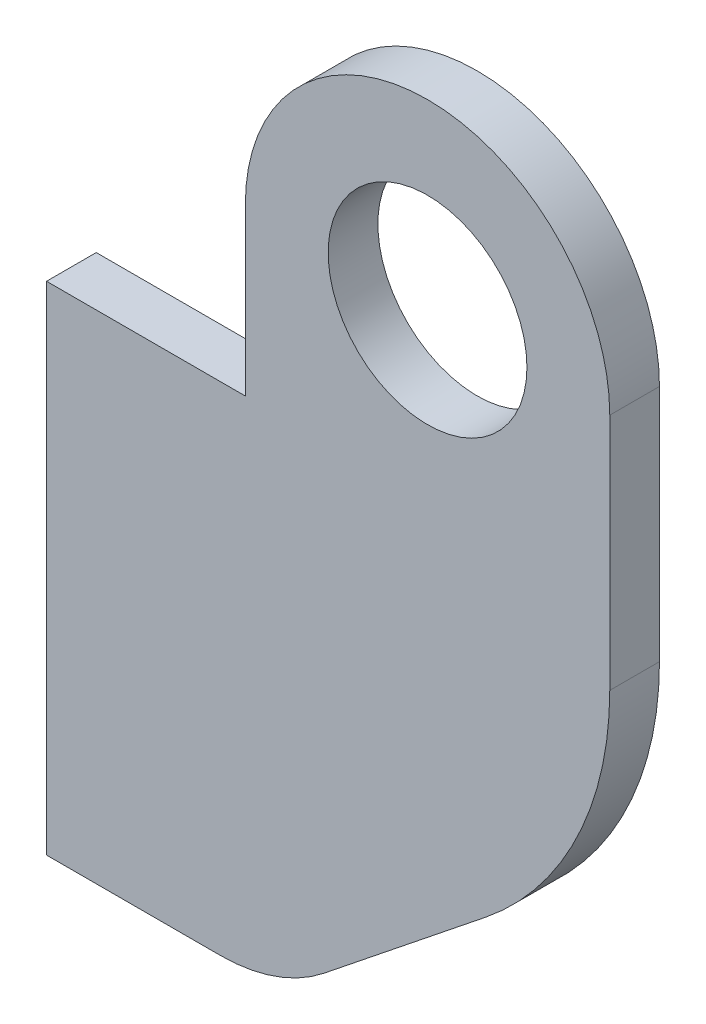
ISO-10303-21;
HEADER;
FILE_DESCRIPTION(('STEP AP214'),'2;1');
FILE_NAME('part.step','',(''),(''),'','','');
FILE_SCHEMA(('AUTOMOTIVE_DESIGN { 1 0 10303 214 1 1 1 1 }'));
ENDSEC;
DATA;
#1=APPLICATION_CONTEXT('core data for automotive mechanical design processes');
#2=APPLICATION_PROTOCOL_DEFINITION('international standard','automotive_design',2000,#1);
#3=PRODUCT_CONTEXT('',#1,'mechanical');
#4=PRODUCT('Part','Part','',(#3));
#5=PRODUCT_RELATED_PRODUCT_CATEGORY('part','',(#4));
#6=PRODUCT_DEFINITION_FORMATION('','',#4);
#7=PRODUCT_DEFINITION_CONTEXT('part definition',#1,'design');
#8=PRODUCT_DEFINITION('design','',#6,#7);
#9=PRODUCT_DEFINITION_SHAPE('','',#8);
#10=(LENGTH_UNIT() NAMED_UNIT(*) SI_UNIT(.MILLI.,.METRE.));
#11=(NAMED_UNIT(*) PLANE_ANGLE_UNIT() SI_UNIT($,.RADIAN.));
#12=(NAMED_UNIT(*) SI_UNIT($,.STERADIAN.) SOLID_ANGLE_UNIT());
#13=UNCERTAINTY_MEASURE_WITH_UNIT(LENGTH_MEASURE(1.E-05),#10,'distance_accuracy_value','');
#14=(GEOMETRIC_REPRESENTATION_CONTEXT(3) GLOBAL_UNCERTAINTY_ASSIGNED_CONTEXT((#13)) GLOBAL_UNIT_ASSIGNED_CONTEXT((#10,
#11,#12)) REPRESENTATION_CONTEXT('',''));
#15=CARTESIAN_POINT('',(0.,0.,0.));
#16=DIRECTION('',(0.,0.,1.));
#17=DIRECTION('',(1.,0.,0.));
#18=AXIS2_PLACEMENT_3D('',#15,#16,#17);
#19=CARTESIAN_POINT('',(115.,50.,7.5));
#20=DIRECTION('',(0.,0.,1.));
#21=DIRECTION('',(1.,0.,0.));
#22=AXIS2_PLACEMENT_3D('',#19,#20,#21);
#23=PLANE('',#22);
#24=DIRECTION('',(1.,0.,0.));
#25=VECTOR('',#24,1.);
#26=CARTESIAN_POINT('',(0.,-150.,7.5));
#27=LINE('',#26,#25);
#28=CARTESIAN_POINT('',(0.,-150.,7.5));
#29=VERTEX_POINT('',#28);
#30=CARTESIAN_POINT('',(52.4609470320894,-150.,7.5));
#31=VERTEX_POINT('',#30);
#32=EDGE_CURVE('E113',#29,#31,#27,.T.);
#33=ORIENTED_EDGE('',*,*,#32,.T.);
#34=CARTESIAN_POINT('',(52.4609470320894,-100.,7.5));
#35=DIRECTION('',(0.,0.,1.));
#36=DIRECTION('',(1.,0.,0.));
#37=AXIS2_PLACEMENT_3D('',#34,#35,#36);
#38=CIRCLE('',#37,50.);
#39=CARTESIAN_POINT('',(83.6956994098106,-139.043440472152,7.5));
#40=VERTEX_POINT('',#39);
#41=EDGE_CURVE('E11',#31,#40,#38,.T.);
#42=ORIENTED_EDGE('',*,*,#41,.T.);
#43=DIRECTION('',(0.78086880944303,0.624695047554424,0.));
#44=VECTOR('',#43,1.);
#45=CARTESIAN_POINT('',(70.,-150.,7.5));
#46=LINE('',#45,#44);
#47=CARTESIAN_POINT('',(132.469504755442,-100.024396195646,7.5));
#48=VERTEX_POINT('',#47);
#49=EDGE_CURVE('E152',#40,#48,#46,.T.);
#50=ORIENTED_EDGE('',*,*,#49,.T.);
#51=CARTESIAN_POINT('',(70.,-21.937515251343,7.5));
#52=DIRECTION('',(0.,0.,1.));
#53=DIRECTION('',(1.,0.,0.));
#54=AXIS2_PLACEMENT_3D('',#51,#52,#53);
#55=CIRCLE('',#54,100.);
#56=CARTESIAN_POINT('',(170.,-21.937515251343,7.5));
#57=VERTEX_POINT('',#56);
#58=EDGE_CURVE('E142',#48,#57,#55,.T.);
#59=ORIENTED_EDGE('',*,*,#58,.T.);
#60=DIRECTION('',(0.,1.,0.));
#61=VECTOR('',#60,1.);
#62=CARTESIAN_POINT('',(170.,-70.,7.5));
#63=LINE('',#62,#61);
#64=CARTESIAN_POINT('',(170.,50.,7.5));
#65=VERTEX_POINT('',#64);
#66=EDGE_CURVE('E188',#57,#65,#63,.T.);
#67=ORIENTED_EDGE('',*,*,#66,.T.);
#68=CARTESIAN_POINT('',(115.,50.,7.5));
#69=DIRECTION('',(0.,0.,1.));
#70=DIRECTION('',(1.,0.,0.));
#71=AXIS2_PLACEMENT_3D('',#68,#69,#70);
#72=CIRCLE('',#71,55.);
#73=CARTESIAN_POINT('',(60.,50.,7.5));
#74=VERTEX_POINT('',#73);
#75=EDGE_CURVE('E181',#65,#74,#72,.T.);
#76=ORIENTED_EDGE('',*,*,#75,.T.);
#77=DIRECTION('',(0.,-1.,0.));
#78=VECTOR('',#77,1.);
#79=CARTESIAN_POINT('',(60.,50.,7.5));
#80=LINE('',#79,#78);
#81=CARTESIAN_POINT('',(60.,0.,7.5));
#82=VERTEX_POINT('',#81);
#83=EDGE_CURVE('E119',#74,#82,#80,.T.);
#84=ORIENTED_EDGE('',*,*,#83,.T.);
#85=DIRECTION('',(-1.,0.,0.));
#86=VECTOR('',#85,1.);
#87=CARTESIAN_POINT('',(60.,0.,7.5));
#88=LINE('',#87,#86);
#89=CARTESIAN_POINT('',(0.,0.,7.5));
#90=VERTEX_POINT('',#89);
#91=EDGE_CURVE('E114',#82,#90,#88,.T.);
#92=ORIENTED_EDGE('',*,*,#91,.T.);
#93=DIRECTION('',(0.,-1.,0.));
#94=VECTOR('',#93,1.);
#95=CARTESIAN_POINT('',(0.,0.,7.5));
#96=LINE('',#95,#94);
#97=EDGE_CURVE('E104',#90,#29,#96,.T.);
#98=ORIENTED_EDGE('',*,*,#97,.T.);
#99=EDGE_LOOP('',(#33,#42,#50,#59,#67,#76,#84,#92,#98));
#100=FACE_BOUND('',#99,.T.);
#101=CARTESIAN_POINT('',(115.,50.,7.5));
#102=DIRECTION('',(0.,0.,1.));
#103=DIRECTION('',(1.,0.,0.));
#104=AXIS2_PLACEMENT_3D('',#101,#102,#103);
#105=CIRCLE('',#104,29.9999999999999);
#106=CARTESIAN_POINT('',(145.,50.,7.5));
#107=VERTEX_POINT('',#106);
#108=EDGE_CURVE('E192',#107,#107,#105,.T.);
#109=ORIENTED_EDGE('',*,*,#108,.F.);
#110=EDGE_LOOP('',(#109));
#111=FACE_BOUND('',#110,.T.);
#112=ADVANCED_FACE('F33',(#100,#111),#23,.T.);
#113=CARTESIAN_POINT('',(115.,50.,-7.5));
#114=DIRECTION('',(0.,0.,1.));
#115=DIRECTION('',(1.,0.,0.));
#116=AXIS2_PLACEMENT_3D('',#113,#114,#115);
#117=PLANE('',#116);
#118=DIRECTION('',(0.78086880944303,0.624695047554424,0.));
#119=VECTOR('',#118,1.);
#120=CARTESIAN_POINT('',(70.,-150.,-7.5));
#121=LINE('',#120,#119);
#122=CARTESIAN_POINT('',(83.6956994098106,-139.043440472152,-7.5));
#123=VERTEX_POINT('',#122);
#124=CARTESIAN_POINT('',(132.469504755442,-100.024396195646,-7.5));
#125=VERTEX_POINT('',#124);
#126=EDGE_CURVE('E151',#123,#125,#121,.T.);
#127=ORIENTED_EDGE('',*,*,#126,.F.);
#128=CARTESIAN_POINT('',(52.4609470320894,-100.,-7.5));
#129=DIRECTION('',(0.,0.,1.));
#130=DIRECTION('',(1.,0.,0.));
#131=AXIS2_PLACEMENT_3D('',#128,#129,#130);
#132=CIRCLE('',#131,50.);
#133=CARTESIAN_POINT('',(52.4609470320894,-150.,-7.5));
#134=VERTEX_POINT('',#133);
#135=EDGE_CURVE('E55',#123,#134,#132,.F.);
#136=ORIENTED_EDGE('',*,*,#135,.T.);
#137=DIRECTION('',(1.,0.,0.));
#138=VECTOR('',#137,1.);
#139=CARTESIAN_POINT('',(0.,-150.,-7.5));
#140=LINE('',#139,#138);
#141=CARTESIAN_POINT('',(0.,-150.,-7.5));
#142=VERTEX_POINT('',#141);
#143=EDGE_CURVE('E160',#142,#134,#140,.T.);
#144=ORIENTED_EDGE('',*,*,#143,.F.);
#145=DIRECTION('',(0.,-1.,0.));
#146=VECTOR('',#145,1.);
#147=CARTESIAN_POINT('',(0.,0.,-7.5));
#148=LINE('',#147,#146);
#149=CARTESIAN_POINT('',(0.,0.,-7.5));
#150=VERTEX_POINT('',#149);
#151=EDGE_CURVE('E164',#150,#142,#148,.T.);
#152=ORIENTED_EDGE('',*,*,#151,.F.);
#153=DIRECTION('',(-1.,0.,0.));
#154=VECTOR('',#153,1.);
#155=CARTESIAN_POINT('',(60.,0.,-7.5));
#156=LINE('',#155,#154);
#157=CARTESIAN_POINT('',(60.,0.,-7.5));
#158=VERTEX_POINT('',#157);
#159=EDGE_CURVE('E127',#158,#150,#156,.T.);
#160=ORIENTED_EDGE('',*,*,#159,.F.);
#161=DIRECTION('',(0.,-1.,0.));
#162=VECTOR('',#161,1.);
#163=CARTESIAN_POINT('',(60.,50.,-7.5));
#164=LINE('',#163,#162);
#165=CARTESIAN_POINT('',(60.,50.,-7.5));
#166=VERTEX_POINT('',#165);
#167=EDGE_CURVE('E123',#166,#158,#164,.T.);
#168=ORIENTED_EDGE('',*,*,#167,.F.);
#169=CARTESIAN_POINT('',(115.,50.,-7.5));
#170=DIRECTION('',(0.,0.,1.));
#171=DIRECTION('',(1.,0.,0.));
#172=AXIS2_PLACEMENT_3D('',#169,#170,#171);
#173=CIRCLE('',#172,55.);
#174=CARTESIAN_POINT('',(170.,50.,-7.5));
#175=VERTEX_POINT('',#174);
#176=EDGE_CURVE('E162',#175,#166,#173,.T.);
#177=ORIENTED_EDGE('',*,*,#176,.F.);
#178=DIRECTION('',(0.,1.,0.));
#179=VECTOR('',#178,1.);
#180=CARTESIAN_POINT('',(170.,-70.,-7.5));
#181=LINE('',#180,#179);
#182=CARTESIAN_POINT('',(170.,-21.937515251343,-7.5));
#183=VERTEX_POINT('',#182);
#184=EDGE_CURVE('E159',#183,#175,#181,.T.);
#185=ORIENTED_EDGE('',*,*,#184,.F.);
#186=CARTESIAN_POINT('',(70.,-21.937515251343,-7.5));
#187=DIRECTION('',(0.,0.,1.));
#188=DIRECTION('',(1.,0.,0.));
#189=AXIS2_PLACEMENT_3D('',#186,#187,#188);
#190=CIRCLE('',#189,100.);
#191=EDGE_CURVE('E131',#183,#125,#190,.F.);
#192=ORIENTED_EDGE('',*,*,#191,.T.);
#193=EDGE_LOOP('',(#127,#136,#144,#152,#160,#168,#177,#185,#192));
#194=FACE_BOUND('',#193,.T.);
#195=CARTESIAN_POINT('',(115.,50.,-7.5));
#196=DIRECTION('',(0.,0.,1.));
#197=DIRECTION('',(1.,0.,0.));
#198=AXIS2_PLACEMENT_3D('',#195,#196,#197);
#199=CIRCLE('',#198,29.9999999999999);
#200=CARTESIAN_POINT('',(145.,50.,-7.5));
#201=VERTEX_POINT('',#200);
#202=EDGE_CURVE('E302',#201,#201,#199,.T.);
#203=ORIENTED_EDGE('',*,*,#202,.T.);
#204=EDGE_LOOP('',(#203));
#205=FACE_BOUND('',#204,.T.);
#206=ADVANCED_FACE('F155',(#194,#205),#117,.F.);
#207=CARTESIAN_POINT('',(60.,0.,7.5));
#208=DIRECTION('',(0.,-1.,0.));
#209=DIRECTION('',(1.,0.,0.));
#210=AXIS2_PLACEMENT_3D('',#207,#208,#209);
#211=PLANE('',#210);
#212=ORIENTED_EDGE('',*,*,#159,.T.);
#213=DIRECTION('',(0.,0.,-1.));
#214=VECTOR('',#213,1.);
#215=CARTESIAN_POINT('',(0.,0.,7.5));
#216=LINE('',#215,#214);
#217=EDGE_CURVE('E108',#90,#150,#216,.T.);
#218=ORIENTED_EDGE('',*,*,#217,.F.);
#219=ORIENTED_EDGE('',*,*,#91,.F.);
#220=DIRECTION('',(0.,0.,-1.));
#221=VECTOR('',#220,1.);
#222=CARTESIAN_POINT('',(60.,0.,7.5));
#223=LINE('',#222,#221);
#224=EDGE_CURVE('E170',#82,#158,#223,.T.);
#225=ORIENTED_EDGE('',*,*,#224,.T.);
#226=EDGE_LOOP('',(#212,#218,#219,#225));
#227=FACE_BOUND('',#226,.T.);
#228=ADVANCED_FACE('F125',(#227),#211,.F.);
#229=CARTESIAN_POINT('',(0.,0.,7.5));
#230=DIRECTION('',(1.,0.,0.));
#231=DIRECTION('',(0.,1.,0.));
#232=AXIS2_PLACEMENT_3D('',#229,#230,#231);
#233=PLANE('',#232);
#234=ORIENTED_EDGE('',*,*,#151,.T.);
#235=DIRECTION('',(0.,0.,-1.));
#236=VECTOR('',#235,1.);
#237=CARTESIAN_POINT('',(0.,-150.,7.5));
#238=LINE('',#237,#236);
#239=EDGE_CURVE('E111',#29,#142,#238,.T.);
#240=ORIENTED_EDGE('',*,*,#239,.F.);
#241=ORIENTED_EDGE('',*,*,#97,.F.);
#242=ORIENTED_EDGE('',*,*,#217,.T.);
#243=EDGE_LOOP('',(#234,#240,#241,#242));
#244=FACE_BOUND('',#243,.T.);
#245=ADVANCED_FACE('F106',(#244),#233,.F.);
#246=CARTESIAN_POINT('',(0.,-150.,7.5));
#247=DIRECTION('',(0.,1.,0.));
#248=DIRECTION('',(0.,0.,1.));
#249=AXIS2_PLACEMENT_3D('',#246,#247,#248);
#250=PLANE('',#249);
#251=ORIENTED_EDGE('',*,*,#143,.T.);
#252=DIRECTION('',(0.,0.,-1.));
#253=VECTOR('',#252,1.);
#254=CARTESIAN_POINT('',(52.4609470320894,-150.,7.5));
#255=LINE('',#254,#253);
#256=EDGE_CURVE('E41',#134,#31,#255,.F.);
#257=ORIENTED_EDGE('',*,*,#256,.T.);
#258=ORIENTED_EDGE('',*,*,#32,.F.);
#259=ORIENTED_EDGE('',*,*,#239,.T.);
#260=EDGE_LOOP('',(#251,#257,#258,#259));
#261=FACE_BOUND('',#260,.T.);
#262=ADVANCED_FACE('F193',(#261),#250,.F.);
#263=CARTESIAN_POINT('',(70.,-150.,7.5));
#264=DIRECTION('',(-0.624695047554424,0.78086880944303,0.));
#265=DIRECTION('',(-0.78086880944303,-0.624695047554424,0.));
#266=AXIS2_PLACEMENT_3D('',#263,#264,#265);
#267=PLANE('',#266);
#268=ORIENTED_EDGE('',*,*,#49,.F.);
#269=DIRECTION('',(0.,0.,-1.));
#270=VECTOR('',#269,1.);
#271=CARTESIAN_POINT('',(83.6956994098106,-139.043440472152,7.5));
#272=LINE('',#271,#270);
#273=EDGE_CURVE('E144',#40,#123,#272,.T.);
#274=ORIENTED_EDGE('',*,*,#273,.T.);
#275=ORIENTED_EDGE('',*,*,#126,.T.);
#276=DIRECTION('',(0.,0.,-1.));
#277=VECTOR('',#276,1.);
#278=CARTESIAN_POINT('',(132.469504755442,-100.024396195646,7.5));
#279=LINE('',#278,#277);
#280=EDGE_CURVE('E139',#125,#48,#279,.F.);
#281=ORIENTED_EDGE('',*,*,#280,.T.);
#282=EDGE_LOOP('',(#268,#274,#275,#281));
#283=FACE_BOUND('',#282,.T.);
#284=ADVANCED_FACE('F150',(#283),#267,.F.);
#285=CARTESIAN_POINT('',(170.,-70.,7.5));
#286=DIRECTION('',(-1.,0.,0.));
#287=DIRECTION('',(0.,0.,1.));
#288=AXIS2_PLACEMENT_3D('',#285,#286,#287);
#289=PLANE('',#288);
#290=ORIENTED_EDGE('',*,*,#66,.F.);
#291=DIRECTION('',(0.,0.,-1.));
#292=VECTOR('',#291,1.);
#293=CARTESIAN_POINT('',(170.,-21.937515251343,7.5));
#294=LINE('',#293,#292);
#295=EDGE_CURVE('E128',#57,#183,#294,.T.);
#296=ORIENTED_EDGE('',*,*,#295,.T.);
#297=ORIENTED_EDGE('',*,*,#184,.T.);
#298=DIRECTION('',(0.,0.,-1.));
#299=VECTOR('',#298,1.);
#300=CARTESIAN_POINT('',(170.,50.,7.5));
#301=LINE('',#300,#299);
#302=EDGE_CURVE('E133',#65,#175,#301,.T.);
#303=ORIENTED_EDGE('',*,*,#302,.F.);
#304=EDGE_LOOP('',(#290,#296,#297,#303));
#305=FACE_BOUND('',#304,.T.);
#306=ADVANCED_FACE('F198',(#305),#289,.F.);
#307=CARTESIAN_POINT('',(115.,50.,7.5));
#308=DIRECTION('',(0.,0.,-1.));
#309=DIRECTION('',(-1.,0.,0.));
#310=AXIS2_PLACEMENT_3D('',#307,#308,#309);
#311=CYLINDRICAL_SURFACE('',#310,55.);
#312=ORIENTED_EDGE('',*,*,#176,.T.);
#313=DIRECTION('',(0.,0.,-1.));
#314=VECTOR('',#313,1.);
#315=CARTESIAN_POINT('',(60.,50.,7.5));
#316=LINE('',#315,#314);
#317=EDGE_CURVE('E172',#74,#166,#316,.T.);
#318=ORIENTED_EDGE('',*,*,#317,.F.);
#319=ORIENTED_EDGE('',*,*,#75,.F.);
#320=ORIENTED_EDGE('',*,*,#302,.T.);
#321=EDGE_LOOP('',(#312,#318,#319,#320));
#322=FACE_BOUND('',#321,.T.);
#323=ADVANCED_FACE('F179',(#322),#311,.T.);
#324=CARTESIAN_POINT('',(60.,50.,7.5));
#325=DIRECTION('',(1.,0.,0.));
#326=DIRECTION('',(0.,1.,0.));
#327=AXIS2_PLACEMENT_3D('',#324,#325,#326);
#328=PLANE('',#327);
#329=ORIENTED_EDGE('',*,*,#167,.T.);
#330=ORIENTED_EDGE('',*,*,#224,.F.);
#331=ORIENTED_EDGE('',*,*,#83,.F.);
#332=ORIENTED_EDGE('',*,*,#317,.T.);
#333=EDGE_LOOP('',(#329,#330,#331,#332));
#334=FACE_BOUND('',#333,.T.);
#335=ADVANCED_FACE('F186',(#334),#328,.F.);
#336=CARTESIAN_POINT('',(115.,50.,7.5));
#337=DIRECTION('',(0.,0.,-1.));
#338=DIRECTION('',(-1.,0.,0.));
#339=AXIS2_PLACEMENT_3D('',#336,#337,#338);
#340=CYLINDRICAL_SURFACE('',#339,29.9999999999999);
#341=ORIENTED_EDGE('',*,*,#108,.T.);
#342=EDGE_LOOP('',(#341));
#343=FACE_BOUND('',#342,.T.);
#344=ORIENTED_EDGE('',*,*,#202,.F.);
#345=EDGE_LOOP('',(#344));
#346=FACE_BOUND('',#345,.T.);
#347=ADVANCED_FACE('F202',(#343,#346),#340,.F.);
#348=CARTESIAN_POINT('',(70.,-21.937515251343,7.5));
#349=DIRECTION('',(0.,0.,-1.));
#350=DIRECTION('',(-1.,0.,0.));
#351=AXIS2_PLACEMENT_3D('',#348,#349,#350);
#352=CYLINDRICAL_SURFACE('',#351,100.);
#353=ORIENTED_EDGE('',*,*,#58,.F.);
#354=ORIENTED_EDGE('',*,*,#280,.F.);
#355=ORIENTED_EDGE('',*,*,#191,.F.);
#356=ORIENTED_EDGE('',*,*,#295,.F.);
#357=EDGE_LOOP('',(#353,#354,#355,#356));
#358=FACE_BOUND('',#357,.T.);
#359=ADVANCED_FACE('F200',(#358),#352,.T.);
#360=CARTESIAN_POINT('',(52.4609470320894,-100.,7.5));
#361=DIRECTION('',(0.,0.,-1.));
#362=DIRECTION('',(-1.,0.,0.));
#363=AXIS2_PLACEMENT_3D('',#360,#361,#362);
#364=CYLINDRICAL_SURFACE('',#363,50.);
#365=ORIENTED_EDGE('',*,*,#41,.F.);
#366=ORIENTED_EDGE('',*,*,#256,.F.);
#367=ORIENTED_EDGE('',*,*,#135,.F.);
#368=ORIENTED_EDGE('',*,*,#273,.F.);
#369=EDGE_LOOP('',(#365,#366,#367,#368));
#370=FACE_BOUND('',#369,.T.);
#371=ADVANCED_FACE('F35',(#370),#364,.T.);
#372=CLOSED_SHELL('',(#112,#206,#228,#245,#262,#284,#306,#323,#335,#347,#359,#371));
#373=MANIFOLD_SOLID_BREP('B2',#372);
#374=ADVANCED_BREP_SHAPE_REPRESENTATION('',(#18,#373),#14);
#375=SHAPE_DEFINITION_REPRESENTATION(#9,#374);
ENDSEC;
END-ISO-10303-21;
